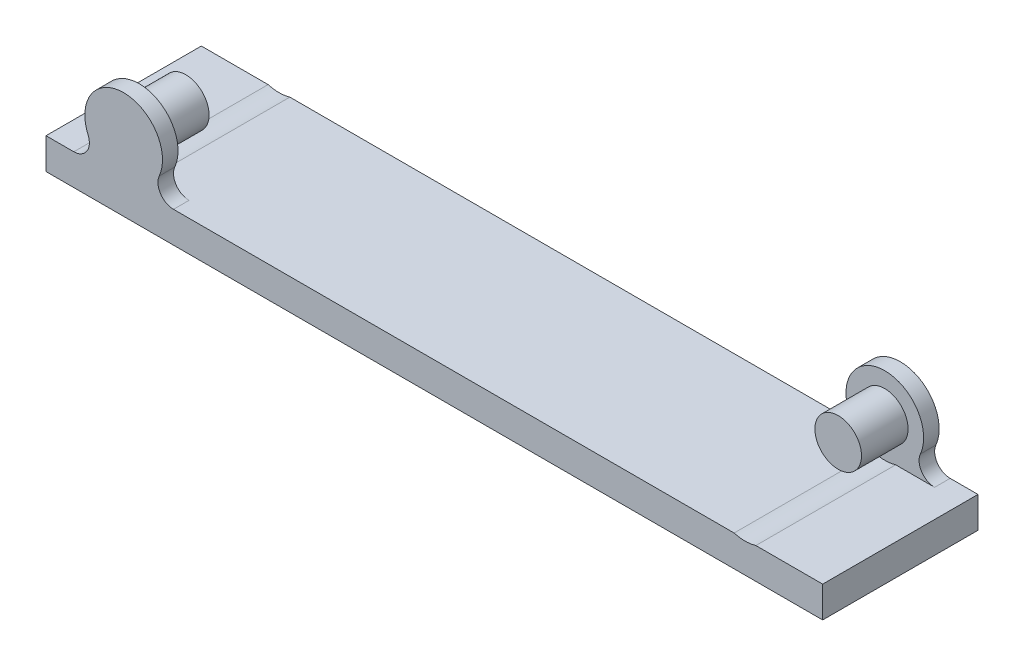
ISO-10303-21;
HEADER;
FILE_DESCRIPTION(('STEP AP214'),'2;1');
FILE_NAME('part.step','',(''),(''),'','','');
FILE_SCHEMA(('AUTOMOTIVE_DESIGN { 1 0 10303 214 1 1 1 1 }'));
ENDSEC;
DATA;
#1=APPLICATION_CONTEXT('core data for automotive mechanical design processes');
#2=APPLICATION_PROTOCOL_DEFINITION('international standard','automotive_design',2000,#1);
#3=PRODUCT_CONTEXT('',#1,'mechanical');
#4=PRODUCT('Part','Part','',(#3));
#5=PRODUCT_RELATED_PRODUCT_CATEGORY('part','',(#4));
#6=PRODUCT_DEFINITION_FORMATION('','',#4);
#7=PRODUCT_DEFINITION_CONTEXT('part definition',#1,'design');
#8=PRODUCT_DEFINITION('design','',#6,#7);
#9=PRODUCT_DEFINITION_SHAPE('','',#8);
#10=(LENGTH_UNIT() NAMED_UNIT(*) SI_UNIT(.MILLI.,.METRE.));
#11=(NAMED_UNIT(*) PLANE_ANGLE_UNIT() SI_UNIT($,.RADIAN.));
#12=(NAMED_UNIT(*) SI_UNIT($,.STERADIAN.) SOLID_ANGLE_UNIT());
#13=UNCERTAINTY_MEASURE_WITH_UNIT(LENGTH_MEASURE(1.E-05),#10,'distance_accuracy_value','');
#14=(GEOMETRIC_REPRESENTATION_CONTEXT(3) GLOBAL_UNCERTAINTY_ASSIGNED_CONTEXT((#13)) GLOBAL_UNIT_ASSIGNED_CONTEXT((#10,
#11,#12)) REPRESENTATION_CONTEXT('',''));
#15=CARTESIAN_POINT('',(0.,0.,0.));
#16=DIRECTION('',(0.,0.,1.));
#17=DIRECTION('',(1.,0.,0.));
#18=AXIS2_PLACEMENT_3D('',#15,#16,#17);
#19=CARTESIAN_POINT('',(50.,44.,40.));
#20=DIRECTION('',(0.,0.,-1.));
#21=DIRECTION('',(-1.,0.,0.));
#22=AXIS2_PLACEMENT_3D('',#19,#20,#21);
#23=CYLINDRICAL_SURFACE('',#22,15.);
#24=CARTESIAN_POINT('',(50.,44.,40.));
#25=DIRECTION('',(0.,0.,-1.));
#26=DIRECTION('',(-1.,0.,0.));
#27=AXIS2_PLACEMENT_3D('',#24,#25,#26);
#28=CIRCLE('',#27,15.);
#29=CARTESIAN_POINT('',(35.,44.,40.));
#30=VERTEX_POINT('',#29);
#31=EDGE_CURVE('E145',#30,#30,#28,.T.);
#32=ORIENTED_EDGE('',*,*,#31,.T.);
#33=EDGE_LOOP('',(#32));
#34=FACE_BOUND('',#33,.T.);
#35=CARTESIAN_POINT('',(50.,44.,10.));
#36=DIRECTION('',(0.,0.,-1.));
#37=DIRECTION('',(-1.,0.,0.));
#38=AXIS2_PLACEMENT_3D('',#35,#36,#37);
#39=CIRCLE('',#38,15.);
#40=CARTESIAN_POINT('',(35.,44.,10.));
#41=VERTEX_POINT('',#40);
#42=EDGE_CURVE('E294',#41,#41,#39,.T.);
#43=ORIENTED_EDGE('',*,*,#42,.F.);
#44=EDGE_LOOP('',(#43));
#45=FACE_BOUND('',#44,.T.);
#46=ADVANCED_FACE('F16',(#34,#45),#23,.T.);
#47=CARTESIAN_POINT('',(50.,44.,-50.));
#48=DIRECTION('',(0.,0.,1.));
#49=DIRECTION('',(1.,0.,0.));
#50=AXIS2_PLACEMENT_3D('',#47,#48,#49);
#51=CYLINDRICAL_SURFACE('',#50,25.);
#52=CARTESIAN_POINT('',(50.,44.,40.));
#53=DIRECTION('',(0.,0.,-1.));
#54=DIRECTION('',(-1.,0.,0.));
#55=AXIS2_PLACEMENT_3D('',#52,#53,#54);
#56=CIRCLE('',#55,25.);
#57=CARTESIAN_POINT('',(72.9128784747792,34.0000000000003,40.));
#58=VERTEX_POINT('',#57);
#59=CARTESIAN_POINT('',(27.0871215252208,34.0000000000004,40.));
#60=VERTEX_POINT('',#59);
#61=EDGE_CURVE('E206',#58,#60,#56,.F.);
#62=ORIENTED_EDGE('',*,*,#61,.T.);
#63=DIRECTION('',(0.,0.,1.));
#64=VECTOR('',#63,1.);
#65=CARTESIAN_POINT('',(27.0871215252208,34.,-50.));
#66=LINE('',#65,#64);
#67=CARTESIAN_POINT('',(27.0871215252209,34.0000000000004,50.));
#68=VERTEX_POINT('',#67);
#69=EDGE_CURVE('E216',#60,#68,#66,.T.);
#70=ORIENTED_EDGE('',*,*,#69,.T.);
#71=CARTESIAN_POINT('',(50.,44.,50.));
#72=DIRECTION('',(0.,0.,1.));
#73=DIRECTION('',(-1.,0.,0.));
#74=AXIS2_PLACEMENT_3D('',#71,#72,#73);
#75=CIRCLE('',#74,25.);
#76=CARTESIAN_POINT('',(72.9128784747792,34.0000000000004,50.));
#77=VERTEX_POINT('',#76);
#78=EDGE_CURVE('E230',#77,#68,#75,.T.);
#79=ORIENTED_EDGE('',*,*,#78,.F.);
#80=DIRECTION('',(0.,0.,1.));
#81=VECTOR('',#80,1.);
#82=CARTESIAN_POINT('',(72.9128784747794,34.,-50.));
#83=LINE('',#82,#81);
#84=EDGE_CURVE('E214',#77,#58,#83,.F.);
#85=ORIENTED_EDGE('',*,*,#84,.T.);
#86=EDGE_LOOP('',(#62,#70,#79,#85));
#87=FACE_BOUND('',#86,.T.);
#88=ADVANCED_FACE('F238',(#87),#51,.T.);
#89=CARTESIAN_POINT('',(450.,44.,-40.));
#90=DIRECTION('',(0.,0.,1.));
#91=DIRECTION('',(1.,0.,0.));
#92=AXIS2_PLACEMENT_3D('',#89,#90,#91);
#93=CYLINDRICAL_SURFACE('',#92,15.);
#94=CARTESIAN_POINT('',(450.,44.,-40.));
#95=DIRECTION('',(0.,0.,1.));
#96=DIRECTION('',(1.,0.,0.));
#97=AXIS2_PLACEMENT_3D('',#94,#95,#96);
#98=CIRCLE('',#97,15.);
#99=CARTESIAN_POINT('',(465.,44.,-40.));
#100=VERTEX_POINT('',#99);
#101=EDGE_CURVE('E285',#100,#100,#98,.T.);
#102=ORIENTED_EDGE('',*,*,#101,.T.);
#103=EDGE_LOOP('',(#102));
#104=FACE_BOUND('',#103,.T.);
#105=CARTESIAN_POINT('',(450.,44.,-10.));
#106=DIRECTION('',(0.,0.,1.));
#107=DIRECTION('',(1.,0.,0.));
#108=AXIS2_PLACEMENT_3D('',#105,#106,#107);
#109=CIRCLE('',#108,15.);
#110=CARTESIAN_POINT('',(465.,44.,-10.));
#111=VERTEX_POINT('',#110);
#112=EDGE_CURVE('E288',#111,#111,#109,.T.);
#113=ORIENTED_EDGE('',*,*,#112,.F.);
#114=EDGE_LOOP('',(#113));
#115=FACE_BOUND('',#114,.T.);
#116=ADVANCED_FACE('F308',(#104,#115),#93,.T.);
#117=CARTESIAN_POINT('',(450.,44.,-50.));
#118=DIRECTION('',(0.,0.,1.));
#119=DIRECTION('',(1.,0.,0.));
#120=AXIS2_PLACEMENT_3D('',#117,#118,#119);
#121=CYLINDRICAL_SURFACE('',#120,25.);
#122=CARTESIAN_POINT('',(450.,44.,-50.));
#123=DIRECTION('',(0.,0.,1.));
#124=DIRECTION('',(1.,0.,0.));
#125=AXIS2_PLACEMENT_3D('',#122,#123,#124);
#126=CIRCLE('',#125,25.);
#127=CARTESIAN_POINT('',(472.912878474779,34.,-50.));
#128=VERTEX_POINT('',#127);
#129=CARTESIAN_POINT('',(427.087121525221,34.,-50.));
#130=VERTEX_POINT('',#129);
#131=EDGE_CURVE('E135',#128,#130,#126,.T.);
#132=ORIENTED_EDGE('',*,*,#131,.T.);
#133=DIRECTION('',(0.,0.,1.));
#134=VECTOR('',#133,1.);
#135=CARTESIAN_POINT('',(427.087121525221,34.,-50.));
#136=LINE('',#135,#134);
#137=CARTESIAN_POINT('',(427.087121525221,34.,-40.));
#138=VERTEX_POINT('',#137);
#139=EDGE_CURVE('E191',#130,#138,#136,.T.);
#140=ORIENTED_EDGE('',*,*,#139,.T.);
#141=CARTESIAN_POINT('',(450.,44.,-40.));
#142=DIRECTION('',(0.,0.,1.));
#143=DIRECTION('',(1.,0.,0.));
#144=AXIS2_PLACEMENT_3D('',#141,#142,#143);
#145=CIRCLE('',#144,25.);
#146=CARTESIAN_POINT('',(472.912878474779,34.,-40.));
#147=VERTEX_POINT('',#146);
#148=EDGE_CURVE('E183',#138,#147,#145,.F.);
#149=ORIENTED_EDGE('',*,*,#148,.T.);
#150=DIRECTION('',(0.,0.,1.));
#151=VECTOR('',#150,1.);
#152=CARTESIAN_POINT('',(472.912878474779,34.,-50.));
#153=LINE('',#152,#151);
#154=EDGE_CURVE('E189',#147,#128,#153,.F.);
#155=ORIENTED_EDGE('',*,*,#154,.T.);
#156=EDGE_LOOP('',(#132,#140,#149,#155));
#157=FACE_BOUND('',#156,.T.);
#158=ADVANCED_FACE('F334',(#157),#121,.T.);
#159=CARTESIAN_POINT('',(0.,20.0000000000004,50.));
#160=DIRECTION('',(0.,-1.,0.));
#161=DIRECTION('',(0.,0.,-1.));
#162=AXIS2_PLACEMENT_3D('',#159,#160,#161);
#163=PLANE('',#162);
#164=DIRECTION('',(1.,0.,0.));
#165=VECTOR('',#164,1.);
#166=CARTESIAN_POINT('',(0.,20.0000000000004,40.));
#167=LINE('',#166,#165);
#168=CARTESIAN_POINT('',(57.,20.0000000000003,40.));
#169=VERTEX_POINT('',#168);
#170=CARTESIAN_POINT('',(82.0780298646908,20.,40.));
#171=VERTEX_POINT('',#170);
#172=EDGE_CURVE('E30',#169,#171,#167,.T.);
#173=ORIENTED_EDGE('',*,*,#172,.T.);
#174=DIRECTION('',(0.,0.,1.));
#175=VECTOR('',#174,1.);
#176=CARTESIAN_POINT('',(82.0780298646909,20.,50.));
#177=LINE('',#176,#175);
#178=CARTESIAN_POINT('',(82.0780298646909,20.,50.));
#179=VERTEX_POINT('',#178);
#180=EDGE_CURVE('E219',#171,#179,#177,.T.);
#181=ORIENTED_EDGE('',*,*,#180,.T.);
#182=DIRECTION('',(-1.,0.,0.));
#183=VECTOR('',#182,1.);
#184=CARTESIAN_POINT('',(0.,20.0000000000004,50.));
#185=LINE('',#184,#183);
#186=CARTESIAN_POINT('',(443.,20.,50.));
#187=VERTEX_POINT('',#186);
#188=EDGE_CURVE('E171',#187,#179,#185,.T.);
#189=ORIENTED_EDGE('',*,*,#188,.F.);
#190=DIRECTION('',(0.,0.,1.));
#191=VECTOR('',#190,1.);
#192=CARTESIAN_POINT('',(443.,20.,-50.));
#193=LINE('',#192,#191);
#194=CARTESIAN_POINT('',(443.,20.,-40.));
#195=VERTEX_POINT('',#194);
#196=EDGE_CURVE('E244',#187,#195,#193,.F.);
#197=ORIENTED_EDGE('',*,*,#196,.T.);
#198=DIRECTION('',(-1.,0.,0.));
#199=VECTOR('',#198,1.);
#200=CARTESIAN_POINT('',(0.,20.,-40.));
#201=LINE('',#200,#199);
#202=CARTESIAN_POINT('',(417.921970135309,20.,-40.));
#203=VERTEX_POINT('',#202);
#204=EDGE_CURVE('E186',#195,#203,#201,.T.);
#205=ORIENTED_EDGE('',*,*,#204,.T.);
#206=DIRECTION('',(0.,0.,1.));
#207=VECTOR('',#206,1.);
#208=CARTESIAN_POINT('',(417.921970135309,20.,50.));
#209=LINE('',#208,#207);
#210=CARTESIAN_POINT('',(417.921970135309,20.,-50.));
#211=VERTEX_POINT('',#210);
#212=EDGE_CURVE('E151',#203,#211,#209,.F.);
#213=ORIENTED_EDGE('',*,*,#212,.T.);
#214=DIRECTION('',(-1.,0.,0.));
#215=VECTOR('',#214,1.);
#216=CARTESIAN_POINT('',(0.,20.,-50.));
#217=LINE('',#216,#215);
#218=CARTESIAN_POINT('',(57.,20.,-50.));
#219=VERTEX_POINT('',#218);
#220=EDGE_CURVE('E142',#211,#219,#217,.T.);
#221=ORIENTED_EDGE('',*,*,#220,.T.);
#222=DIRECTION('',(0.,0.,1.));
#223=VECTOR('',#222,1.);
#224=CARTESIAN_POINT('',(57.,20.,-50.));
#225=LINE('',#224,#223);
#226=EDGE_CURVE('E126',#219,#169,#225,.T.);
#227=ORIENTED_EDGE('',*,*,#226,.T.);
#228=EDGE_LOOP('',(#173,#181,#189,#197,#205,#213,#221,#227));
#229=FACE_BOUND('',#228,.T.);
#230=ADVANCED_FACE('F148',(#229),#163,.F.);
#231=CARTESIAN_POINT('',(500.,20.,-50.));
#232=VERTEX_POINT('',#231);
#233=CARTESIAN_POINT('',(482.078029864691,20.,-50.));
#234=VERTEX_POINT('',#233);
#235=EDGE_CURVE('E152',#232,#234,#217,.T.);
#236=ORIENTED_EDGE('',*,*,#235,.T.);
#237=DIRECTION('',(0.,0.,1.));
#238=VECTOR('',#237,1.);
#239=CARTESIAN_POINT('',(482.078029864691,20.,50.));
#240=LINE('',#239,#238);
#241=CARTESIAN_POINT('',(482.078029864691,20.,-40.));
#242=VERTEX_POINT('',#241);
#243=EDGE_CURVE('E195',#234,#242,#240,.T.);
#244=ORIENTED_EDGE('',*,*,#243,.T.);
#245=DIRECTION('',(-1.,0.,0.));
#246=VECTOR('',#245,1.);
#247=CARTESIAN_POINT('',(0.,20.,-40.));
#248=LINE('',#247,#246);
#249=CARTESIAN_POINT('',(457.,20.,-40.));
#250=VERTEX_POINT('',#249);
#251=EDGE_CURVE('E193',#242,#250,#248,.T.);
#252=ORIENTED_EDGE('',*,*,#251,.T.);
#253=DIRECTION('',(0.,0.,1.));
#254=VECTOR('',#253,1.);
#255=CARTESIAN_POINT('',(457.,20.,-50.));
#256=LINE('',#255,#254);
#257=CARTESIAN_POINT('',(457.,20.,50.));
#258=VERTEX_POINT('',#257);
#259=EDGE_CURVE('E271',#250,#258,#256,.T.);
#260=ORIENTED_EDGE('',*,*,#259,.T.);
#261=CARTESIAN_POINT('',(500.,20.,50.));
#262=VERTEX_POINT('',#261);
#263=EDGE_CURVE('E167',#262,#258,#185,.T.);
#264=ORIENTED_EDGE('',*,*,#263,.F.);
#265=DIRECTION('',(0.,0.,-1.));
#266=VECTOR('',#265,1.);
#267=CARTESIAN_POINT('',(500.,20.,50.));
#268=LINE('',#267,#266);
#269=EDGE_CURVE('E174',#262,#232,#268,.T.);
#270=ORIENTED_EDGE('',*,*,#269,.T.);
#271=EDGE_LOOP('',(#236,#244,#252,#260,#264,#270));
#272=FACE_BOUND('',#271,.T.);
#273=ADVANCED_FACE('F269',(#272),#163,.F.);
#274=CARTESIAN_POINT('',(0.,0.,50.));
#275=DIRECTION('',(1.,0.,0.));
#276=DIRECTION('',(0.,0.,-1.));
#277=AXIS2_PLACEMENT_3D('',#274,#275,#276);
#278=PLANE('',#277);
#279=DIRECTION('',(0.,-1.,0.));
#280=VECTOR('',#279,1.);
#281=CARTESIAN_POINT('',(0.,0.,-50.));
#282=LINE('',#281,#280);
#283=CARTESIAN_POINT('',(0.,20.,-50.));
#284=VERTEX_POINT('',#283);
#285=CARTESIAN_POINT('',(0.,0.,-50.));
#286=VERTEX_POINT('',#285);
#287=EDGE_CURVE('E255',#284,#286,#282,.T.);
#288=ORIENTED_EDGE('',*,*,#287,.T.);
#289=DIRECTION('',(0.,0.,-1.));
#290=VECTOR('',#289,1.);
#291=CARTESIAN_POINT('',(0.,0.,50.));
#292=LINE('',#291,#290);
#293=CARTESIAN_POINT('',(0.,0.,50.));
#294=VERTEX_POINT('',#293);
#295=EDGE_CURVE('E180',#294,#286,#292,.T.);
#296=ORIENTED_EDGE('',*,*,#295,.F.);
#297=DIRECTION('',(0.,-1.,0.));
#298=VECTOR('',#297,1.);
#299=CARTESIAN_POINT('',(0.,0.,50.));
#300=LINE('',#299,#298);
#301=CARTESIAN_POINT('',(0.,20.0000000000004,50.));
#302=VERTEX_POINT('',#301);
#303=EDGE_CURVE('E155',#302,#294,#300,.T.);
#304=ORIENTED_EDGE('',*,*,#303,.F.);
#305=DIRECTION('',(0.,0.,-1.));
#306=VECTOR('',#305,1.);
#307=CARTESIAN_POINT('',(0.,20.0000000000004,50.));
#308=LINE('',#307,#306);
#309=EDGE_CURVE('E170',#302,#284,#308,.T.);
#310=ORIENTED_EDGE('',*,*,#309,.T.);
#311=EDGE_LOOP('',(#288,#296,#304,#310));
#312=FACE_BOUND('',#311,.T.);
#313=ADVANCED_FACE('F18',(#312),#278,.F.);
#314=CARTESIAN_POINT('',(0.,0.,50.));
#315=DIRECTION('',(0.,1.,0.));
#316=DIRECTION('',(0.,0.,1.));
#317=AXIS2_PLACEMENT_3D('',#314,#315,#316);
#318=PLANE('',#317);
#319=DIRECTION('',(1.,0.,0.));
#320=VECTOR('',#319,1.);
#321=CARTESIAN_POINT('',(0.,0.,-50.));
#322=LINE('',#321,#320);
#323=CARTESIAN_POINT('',(500.,0.,-50.));
#324=VERTEX_POINT('',#323);
#325=EDGE_CURVE('E259',#286,#324,#322,.T.);
#326=ORIENTED_EDGE('',*,*,#325,.T.);
#327=DIRECTION('',(0.,0.,-1.));
#328=VECTOR('',#327,1.);
#329=CARTESIAN_POINT('',(500.,3.88578058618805E-13,50.));
#330=LINE('',#329,#328);
#331=CARTESIAN_POINT('',(500.,3.88578058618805E-13,50.));
#332=VERTEX_POINT('',#331);
#333=EDGE_CURVE('E177',#332,#324,#330,.T.);
#334=ORIENTED_EDGE('',*,*,#333,.F.);
#335=DIRECTION('',(1.,0.,0.));
#336=VECTOR('',#335,1.);
#337=CARTESIAN_POINT('',(0.,0.,50.));
#338=LINE('',#337,#336);
#339=EDGE_CURVE('E162',#294,#332,#338,.T.);
#340=ORIENTED_EDGE('',*,*,#339,.F.);
#341=ORIENTED_EDGE('',*,*,#295,.T.);
#342=EDGE_LOOP('',(#326,#334,#340,#341));
#343=FACE_BOUND('',#342,.T.);
#344=ADVANCED_FACE('F257',(#343),#318,.F.);
#345=CARTESIAN_POINT('',(500.,3.88578058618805E-13,50.));
#346=DIRECTION('',(-1.,0.,0.));
#347=DIRECTION('',(0.,0.,1.));
#348=AXIS2_PLACEMENT_3D('',#345,#346,#347);
#349=PLANE('',#348);
#350=DIRECTION('',(0.,1.,0.));
#351=VECTOR('',#350,1.);
#352=CARTESIAN_POINT('',(500.,0.,-50.));
#353=LINE('',#352,#351);
#354=EDGE_CURVE('E156',#324,#232,#353,.T.);
#355=ORIENTED_EDGE('',*,*,#354,.T.);
#356=ORIENTED_EDGE('',*,*,#269,.F.);
#357=DIRECTION('',(0.,1.,0.));
#358=VECTOR('',#357,1.);
#359=CARTESIAN_POINT('',(500.,3.88578058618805E-13,50.));
#360=LINE('',#359,#358);
#361=EDGE_CURVE('E164',#332,#262,#360,.T.);
#362=ORIENTED_EDGE('',*,*,#361,.F.);
#363=ORIENTED_EDGE('',*,*,#333,.T.);
#364=EDGE_LOOP('',(#355,#356,#362,#363));
#365=FACE_BOUND('',#364,.T.);
#366=ADVANCED_FACE('F264',(#365),#349,.F.);
#367=CARTESIAN_POINT('',(17.9219701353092,20.0000000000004,50.));
#368=VERTEX_POINT('',#367);
#369=EDGE_CURVE('E166',#368,#302,#185,.T.);
#370=ORIENTED_EDGE('',*,*,#369,.F.);
#371=DIRECTION('',(0.,0.,1.));
#372=VECTOR('',#371,1.);
#373=CARTESIAN_POINT('',(17.9219701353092,20.0000000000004,50.));
#374=LINE('',#373,#372);
#375=CARTESIAN_POINT('',(17.9219701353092,20.0000000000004,40.));
#376=VERTEX_POINT('',#375);
#377=EDGE_CURVE('E211',#368,#376,#374,.F.);
#378=ORIENTED_EDGE('',*,*,#377,.T.);
#379=DIRECTION('',(1.,0.,0.));
#380=VECTOR('',#379,1.);
#381=CARTESIAN_POINT('',(0.,20.0000000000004,40.));
#382=LINE('',#381,#380);
#383=CARTESIAN_POINT('',(43.,20.0000000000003,40.));
#384=VERTEX_POINT('',#383);
#385=EDGE_CURVE('E209',#376,#384,#382,.T.);
#386=ORIENTED_EDGE('',*,*,#385,.T.);
#387=DIRECTION('',(0.,0.,1.));
#388=VECTOR('',#387,1.);
#389=CARTESIAN_POINT('',(43.,20.,-50.));
#390=LINE('',#389,#388);
#391=CARTESIAN_POINT('',(43.,20.,-50.));
#392=VERTEX_POINT('',#391);
#393=EDGE_CURVE('E136',#384,#392,#390,.F.);
#394=ORIENTED_EDGE('',*,*,#393,.T.);
#395=EDGE_CURVE('E144',#392,#284,#217,.T.);
#396=ORIENTED_EDGE('',*,*,#395,.T.);
#397=ORIENTED_EDGE('',*,*,#309,.F.);
#398=EDGE_LOOP('',(#370,#378,#386,#394,#396,#397));
#399=FACE_BOUND('',#398,.T.);
#400=ADVANCED_FACE('F252',(#399),#163,.F.);
#401=CARTESIAN_POINT('',(0.,20.0000000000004,50.));
#402=DIRECTION('',(0.,0.,-1.));
#403=DIRECTION('',(-1.,0.,0.));
#404=AXIS2_PLACEMENT_3D('',#401,#402,#403);
#405=PLANE('',#404);
#406=ORIENTED_EDGE('',*,*,#263,.T.);
#407=CARTESIAN_POINT('',(450.,44.,50.));
#408=DIRECTION('',(0.,0.,1.));
#409=DIRECTION('',(1.,0.,0.));
#410=AXIS2_PLACEMENT_3D('',#407,#408,#409);
#411=CIRCLE('',#410,25.);
#412=EDGE_CURVE('E283',#187,#258,#411,.T.);
#413=ORIENTED_EDGE('',*,*,#412,.F.);
#414=ORIENTED_EDGE('',*,*,#188,.T.);
#415=CARTESIAN_POINT('',(82.0780298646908,30.0000000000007,50.));
#416=DIRECTION('',(0.,0.,-1.));
#417=DIRECTION('',(-1.,0.,0.));
#418=AXIS2_PLACEMENT_3D('',#415,#416,#417);
#419=CIRCLE('',#418,10.);
#420=EDGE_CURVE('E24',#179,#77,#419,.T.);
#421=ORIENTED_EDGE('',*,*,#420,.T.);
#422=ORIENTED_EDGE('',*,*,#78,.T.);
#423=CARTESIAN_POINT('',(17.9219701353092,30.,50.));
#424=DIRECTION('',(0.,0.,-1.));
#425=DIRECTION('',(-1.,0.,0.));
#426=AXIS2_PLACEMENT_3D('',#423,#424,#425);
#427=CIRCLE('',#426,10.);
#428=EDGE_CURVE('E224',#68,#368,#427,.T.);
#429=ORIENTED_EDGE('',*,*,#428,.T.);
#430=ORIENTED_EDGE('',*,*,#369,.T.);
#431=ORIENTED_EDGE('',*,*,#303,.T.);
#432=ORIENTED_EDGE('',*,*,#339,.T.);
#433=ORIENTED_EDGE('',*,*,#361,.T.);
#434=EDGE_LOOP('',(#406,#413,#414,#421,#422,#429,#430,#431,#432,#433));
#435=FACE_BOUND('',#434,.T.);
#436=ADVANCED_FACE('F229',(#435),#405,.F.);
#437=CARTESIAN_POINT('',(0.,20.,-50.));
#438=DIRECTION('',(0.,0.,-1.));
#439=DIRECTION('',(-1.,0.,0.));
#440=AXIS2_PLACEMENT_3D('',#437,#438,#439);
#441=PLANE('',#440);
#442=CARTESIAN_POINT('',(50.,44.,-50.));
#443=DIRECTION('',(0.,0.,-1.));
#444=DIRECTION('',(-1.,0.,0.));
#445=AXIS2_PLACEMENT_3D('',#442,#443,#444);
#446=CIRCLE('',#445,25.);
#447=EDGE_CURVE('E130',#219,#392,#446,.T.);
#448=ORIENTED_EDGE('',*,*,#447,.F.);
#449=ORIENTED_EDGE('',*,*,#220,.F.);
#450=CARTESIAN_POINT('',(417.92197013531,30.,-50.));
#451=DIRECTION('',(0.,0.,-1.));
#452=DIRECTION('',(-1.,0.,0.));
#453=AXIS2_PLACEMENT_3D('',#450,#451,#452);
#454=CIRCLE('',#453,10.);
#455=EDGE_CURVE('E198',#211,#130,#454,.F.);
#456=ORIENTED_EDGE('',*,*,#455,.T.);
#457=ORIENTED_EDGE('',*,*,#131,.F.);
#458=CARTESIAN_POINT('',(482.078029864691,30.,-50.));
#459=DIRECTION('',(0.,0.,-1.));
#460=DIRECTION('',(-1.,0.,0.));
#461=AXIS2_PLACEMENT_3D('',#458,#459,#460);
#462=CIRCLE('',#461,10.);
#463=EDGE_CURVE('E204',#128,#234,#462,.F.);
#464=ORIENTED_EDGE('',*,*,#463,.T.);
#465=ORIENTED_EDGE('',*,*,#235,.F.);
#466=ORIENTED_EDGE('',*,*,#354,.F.);
#467=ORIENTED_EDGE('',*,*,#325,.F.);
#468=ORIENTED_EDGE('',*,*,#287,.F.);
#469=ORIENTED_EDGE('',*,*,#395,.F.);
#470=EDGE_LOOP('',(#448,#449,#456,#457,#464,#465,#466,#467,#468,#469));
#471=FACE_BOUND('',#470,.T.);
#472=ADVANCED_FACE('F141',(#471),#441,.T.);
#473=CARTESIAN_POINT('',(450.,44.,-40.));
#474=DIRECTION('',(0.,0.,1.));
#475=DIRECTION('',(1.,0.,0.));
#476=AXIS2_PLACEMENT_3D('',#473,#474,#475);
#477=CYLINDRICAL_SURFACE('',#476,25.);
#478=ORIENTED_EDGE('',*,*,#412,.T.);
#479=ORIENTED_EDGE('',*,*,#259,.F.);
#480=CARTESIAN_POINT('',(450.,44.,-40.));
#481=DIRECTION('',(0.,0.,1.));
#482=DIRECTION('',(1.,0.,0.));
#483=AXIS2_PLACEMENT_3D('',#480,#481,#482);
#484=CIRCLE('',#483,25.);
#485=EDGE_CURVE('E240',#195,#250,#484,.T.);
#486=ORIENTED_EDGE('',*,*,#485,.F.);
#487=ORIENTED_EDGE('',*,*,#196,.F.);
#488=EDGE_LOOP('',(#478,#479,#486,#487));
#489=FACE_BOUND('',#488,.T.);
#490=ADVANCED_FACE('F338',(#489),#477,.F.);
#491=CARTESIAN_POINT('',(450.,44.,-40.));
#492=DIRECTION('',(0.,0.,1.));
#493=DIRECTION('',(1.,0.,0.));
#494=AXIS2_PLACEMENT_3D('',#491,#492,#493);
#495=PLANE('',#494);
#496=ORIENTED_EDGE('',*,*,#101,.F.);
#497=EDGE_LOOP('',(#496));
#498=FACE_BOUND('',#497,.T.);
#499=ORIENTED_EDGE('',*,*,#485,.T.);
#500=ORIENTED_EDGE('',*,*,#251,.F.);
#501=CARTESIAN_POINT('',(482.078029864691,30.,-40.));
#502=DIRECTION('',(0.,0.,1.));
#503=DIRECTION('',(1.,0.,0.));
#504=AXIS2_PLACEMENT_3D('',#501,#502,#503);
#505=CIRCLE('',#504,10.);
#506=EDGE_CURVE('E202',#242,#147,#505,.F.);
#507=ORIENTED_EDGE('',*,*,#506,.T.);
#508=ORIENTED_EDGE('',*,*,#148,.F.);
#509=CARTESIAN_POINT('',(417.92197013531,30.,-40.));
#510=DIRECTION('',(0.,0.,1.));
#511=DIRECTION('',(1.,0.,0.));
#512=AXIS2_PLACEMENT_3D('',#509,#510,#511);
#513=CIRCLE('',#512,10.);
#514=EDGE_CURVE('E200',#138,#203,#513,.F.);
#515=ORIENTED_EDGE('',*,*,#514,.T.);
#516=ORIENTED_EDGE('',*,*,#204,.F.);
#517=EDGE_LOOP('',(#499,#500,#507,#508,#515,#516));
#518=FACE_BOUND('',#517,.T.);
#519=ADVANCED_FACE('F330',(#498,#518),#495,.T.);
#520=CARTESIAN_POINT('',(417.92197013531,30.,-50.));
#521=DIRECTION('',(0.,0.,1.));
#522=DIRECTION('',(1.,0.,0.));
#523=AXIS2_PLACEMENT_3D('',#520,#521,#522);
#524=CYLINDRICAL_SURFACE('',#523,10.);
#525=ORIENTED_EDGE('',*,*,#514,.F.);
#526=ORIENTED_EDGE('',*,*,#139,.F.);
#527=ORIENTED_EDGE('',*,*,#455,.F.);
#528=ORIENTED_EDGE('',*,*,#212,.F.);
#529=EDGE_LOOP('',(#525,#526,#527,#528));
#530=FACE_BOUND('',#529,.T.);
#531=ADVANCED_FACE('F326',(#530),#524,.F.);
#532=CARTESIAN_POINT('',(482.078029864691,30.,-50.));
#533=DIRECTION('',(0.,0.,1.));
#534=DIRECTION('',(1.,0.,0.));
#535=AXIS2_PLACEMENT_3D('',#532,#533,#534);
#536=CYLINDRICAL_SURFACE('',#535,10.);
#537=ORIENTED_EDGE('',*,*,#463,.F.);
#538=ORIENTED_EDGE('',*,*,#154,.F.);
#539=ORIENTED_EDGE('',*,*,#506,.F.);
#540=ORIENTED_EDGE('',*,*,#243,.F.);
#541=EDGE_LOOP('',(#537,#538,#539,#540));
#542=FACE_BOUND('',#541,.T.);
#543=ADVANCED_FACE('F322',(#542),#536,.F.);
#544=CARTESIAN_POINT('',(450.,44.,-10.));
#545=DIRECTION('',(0.,0.,1.));
#546=DIRECTION('',(1.,0.,0.));
#547=AXIS2_PLACEMENT_3D('',#544,#545,#546);
#548=PLANE('',#547);
#549=ORIENTED_EDGE('',*,*,#112,.T.);
#550=EDGE_LOOP('',(#549));
#551=FACE_BOUND('',#550,.T.);
#552=ADVANCED_FACE('F319',(#551),#548,.T.);
#553=CARTESIAN_POINT('',(50.,44.,40.));
#554=DIRECTION('',(0.,0.,-1.));
#555=DIRECTION('',(-1.,0.,0.));
#556=AXIS2_PLACEMENT_3D('',#553,#554,#555);
#557=CYLINDRICAL_SURFACE('',#556,25.);
#558=ORIENTED_EDGE('',*,*,#447,.T.);
#559=ORIENTED_EDGE('',*,*,#393,.F.);
#560=CARTESIAN_POINT('',(50.,44.,40.));
#561=DIRECTION('',(0.,0.,-1.));
#562=DIRECTION('',(-1.,0.,0.));
#563=AXIS2_PLACEMENT_3D('',#560,#561,#562);
#564=CIRCLE('',#563,25.);
#565=EDGE_CURVE('E132',#169,#384,#564,.T.);
#566=ORIENTED_EDGE('',*,*,#565,.F.);
#567=ORIENTED_EDGE('',*,*,#226,.F.);
#568=EDGE_LOOP('',(#558,#559,#566,#567));
#569=FACE_BOUND('',#568,.T.);
#570=ADVANCED_FACE('F128',(#569),#557,.F.);
#571=CARTESIAN_POINT('',(50.,44.,40.));
#572=DIRECTION('',(0.,0.,-1.));
#573=DIRECTION('',(-1.,0.,0.));
#574=AXIS2_PLACEMENT_3D('',#571,#572,#573);
#575=PLANE('',#574);
#576=ORIENTED_EDGE('',*,*,#31,.F.);
#577=EDGE_LOOP('',(#576));
#578=FACE_BOUND('',#577,.T.);
#579=ORIENTED_EDGE('',*,*,#565,.T.);
#580=ORIENTED_EDGE('',*,*,#385,.F.);
#581=CARTESIAN_POINT('',(17.9219701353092,30.,40.));
#582=DIRECTION('',(0.,0.,-1.));
#583=DIRECTION('',(-1.,0.,0.));
#584=AXIS2_PLACEMENT_3D('',#581,#582,#583);
#585=CIRCLE('',#584,10.);
#586=EDGE_CURVE('E222',#376,#60,#585,.F.);
#587=ORIENTED_EDGE('',*,*,#586,.T.);
#588=ORIENTED_EDGE('',*,*,#61,.F.);
#589=CARTESIAN_POINT('',(82.0780298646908,30.0000000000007,40.));
#590=DIRECTION('',(0.,0.,-1.));
#591=DIRECTION('',(-1.,0.,0.));
#592=AXIS2_PLACEMENT_3D('',#589,#590,#591);
#593=CIRCLE('',#592,10.);
#594=EDGE_CURVE('E10',#58,#171,#593,.F.);
#595=ORIENTED_EDGE('',*,*,#594,.T.);
#596=ORIENTED_EDGE('',*,*,#172,.F.);
#597=EDGE_LOOP('',(#579,#580,#587,#588,#595,#596));
#598=FACE_BOUND('',#597,.T.);
#599=ADVANCED_FACE('F313',(#578,#598),#575,.T.);
#600=CARTESIAN_POINT('',(50.,44.,10.));
#601=DIRECTION('',(0.,0.,-1.));
#602=DIRECTION('',(-1.,0.,0.));
#603=AXIS2_PLACEMENT_3D('',#600,#601,#602);
#604=PLANE('',#603);
#605=ORIENTED_EDGE('',*,*,#42,.T.);
#606=EDGE_LOOP('',(#605));
#607=FACE_BOUND('',#606,.T.);
#608=ADVANCED_FACE('F298',(#607),#604,.T.);
#609=CARTESIAN_POINT('',(17.9219701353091,30.,-50.));
#610=DIRECTION('',(0.,0.,1.));
#611=DIRECTION('',(1.,0.,0.));
#612=AXIS2_PLACEMENT_3D('',#609,#610,#611);
#613=CYLINDRICAL_SURFACE('',#612,10.);
#614=ORIENTED_EDGE('',*,*,#428,.F.);
#615=ORIENTED_EDGE('',*,*,#69,.F.);
#616=ORIENTED_EDGE('',*,*,#586,.F.);
#617=ORIENTED_EDGE('',*,*,#377,.F.);
#618=EDGE_LOOP('',(#614,#615,#616,#617));
#619=FACE_BOUND('',#618,.T.);
#620=ADVANCED_FACE('F439',(#619),#613,.F.);
#621=CARTESIAN_POINT('',(82.0780298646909,30.0000000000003,-50.));
#622=DIRECTION('',(0.,0.,1.));
#623=DIRECTION('',(1.,0.,0.));
#624=AXIS2_PLACEMENT_3D('',#621,#622,#623);
#625=CYLINDRICAL_SURFACE('',#624,10.);
#626=ORIENTED_EDGE('',*,*,#594,.F.);
#627=ORIENTED_EDGE('',*,*,#84,.F.);
#628=ORIENTED_EDGE('',*,*,#420,.F.);
#629=ORIENTED_EDGE('',*,*,#180,.F.);
#630=EDGE_LOOP('',(#626,#627,#628,#629));
#631=FACE_BOUND('',#630,.T.);
#632=ADVANCED_FACE('F242',(#631),#625,.F.);
#633=CLOSED_SHELL('',(#46,#88,#116,#158,#230,#273,#313,#344,#366,#400,#436,#472,#490,#519,#531,
#543,#552,#570,#599,#608,#620,#632));
#634=MANIFOLD_SOLID_BREP('B1',#633);
#635=ADVANCED_BREP_SHAPE_REPRESENTATION('',(#18,#634),#14);
#636=SHAPE_DEFINITION_REPRESENTATION(#9,#635);
ENDSEC;
END-ISO-10303-21;
